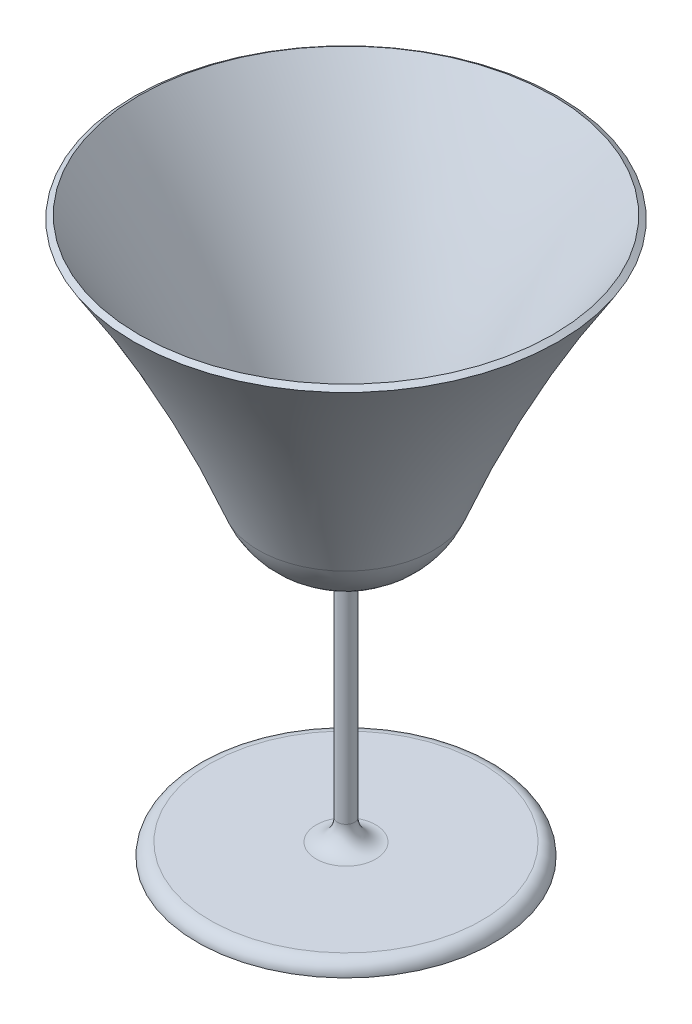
ISO-10303-21;
HEADER;
FILE_DESCRIPTION(('STEP AP214'),'2;1');
FILE_NAME('part.step','',(''),(''),'','','');
FILE_SCHEMA(('AUTOMOTIVE_DESIGN { 1 0 10303 214 1 1 1 1 }'));
ENDSEC;
DATA;
#1=APPLICATION_CONTEXT('core data for automotive mechanical design processes');
#2=APPLICATION_PROTOCOL_DEFINITION('international standard','automotive_design',2000,#1);
#3=PRODUCT_CONTEXT('',#1,'mechanical');
#4=PRODUCT('Part','Part','',(#3));
#5=PRODUCT_RELATED_PRODUCT_CATEGORY('part','',(#4));
#6=PRODUCT_DEFINITION_FORMATION('','',#4);
#7=PRODUCT_DEFINITION_CONTEXT('part definition',#1,'design');
#8=PRODUCT_DEFINITION('design','',#6,#7);
#9=PRODUCT_DEFINITION_SHAPE('','',#8);
#10=(LENGTH_UNIT() NAMED_UNIT(*) SI_UNIT(.MILLI.,.METRE.));
#11=(NAMED_UNIT(*) PLANE_ANGLE_UNIT() SI_UNIT($,.RADIAN.));
#12=(NAMED_UNIT(*) SI_UNIT($,.STERADIAN.) SOLID_ANGLE_UNIT());
#13=UNCERTAINTY_MEASURE_WITH_UNIT(LENGTH_MEASURE(1.E-05),#10,'distance_accuracy_value','');
#14=(GEOMETRIC_REPRESENTATION_CONTEXT(3) GLOBAL_UNCERTAINTY_ASSIGNED_CONTEXT((#13)) GLOBAL_UNIT_ASSIGNED_CONTEXT((#10,
#11,#12)) REPRESENTATION_CONTEXT('',''));
#15=CARTESIAN_POINT('',(0.,0.,0.));
#16=DIRECTION('',(0.,0.,1.));
#17=DIRECTION('',(1.,0.,0.));
#18=AXIS2_PLACEMENT_3D('',#15,#16,#17);
#19=CARTESIAN_POINT('',(0.,-34.7348550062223,0.));
#20=DIRECTION('',(0.,-1.,0.));
#21=DIRECTION('',(0.,0.,-1.));
#22=AXIS2_PLACEMENT_3D('',#19,#20,#21);
#23=DEGENERATE_TOROIDAL_SURFACE('',#22,300.723807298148,301.5,.T.);
#24=CARTESIAN_POINT('',(0.,130.823674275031,0.));
#25=DIRECTION('',(0.,-1.,0.));
#26=DIRECTION('',(0.,0.,-1.));
#27=AXIS2_PLACEMENT_3D('',#24,#25,#26);
#28=CIRCLE('',#27,48.7463809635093);
#29=CARTESIAN_POINT('',(0.,130.823674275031,-48.7463809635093));
#30=VERTEX_POINT('',#29);
#31=EDGE_CURVE('E11',#30,#30,#28,.T.);
#32=ORIENTED_EDGE('',*,*,#31,.F.);
#33=EDGE_LOOP('',(#32));
#34=FACE_BOUND('',#33,.T.);
#35=CARTESIAN_POINT('',(0.,73.3668911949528,0.));
#36=DIRECTION('',(0.,-1.,0.));
#37=DIRECTION('',(0.,0.,-1.));
#38=AXIS2_PLACEMENT_3D('',#35,#36,#37);
#39=CIRCLE('',#38,19.2699701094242);
#40=CARTESIAN_POINT('',(0.,73.3668911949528,-19.2699701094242));
#41=VERTEX_POINT('',#40);
#42=EDGE_CURVE('E60',#41,#41,#39,.T.);
#43=ORIENTED_EDGE('',*,*,#42,.T.);
#44=EDGE_LOOP('',(#43));
#45=FACE_BOUND('',#44,.T.);
#46=ADVANCED_FACE('F38',(#34,#45),#23,.T.);
#47=CARTESIAN_POINT('',(0.,130.,0.));
#48=DIRECTION('',(0.,-1.,0.));
#49=DIRECTION('',(0.,0.,-1.));
#50=AXIS2_PLACEMENT_3D('',#47,#48,#49);
#51=CONICAL_SURFACE('',#50,50.,0.989489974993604);
#52=ORIENTED_EDGE('',*,*,#31,.T.);
#53=EDGE_LOOP('',(#52));
#54=FACE_BOUND('',#53,.T.);
#55=CARTESIAN_POINT('',(0.,130.,0.));
#56=DIRECTION('',(0.,-1.,0.));
#57=DIRECTION('',(0.,0.,-1.));
#58=AXIS2_PLACEMENT_3D('',#55,#56,#57);
#59=CIRCLE('',#58,50.);
#60=CARTESIAN_POINT('',(0.,130.,-50.));
#61=VERTEX_POINT('',#60);
#62=EDGE_CURVE('E44',#61,#61,#59,.T.);
#63=ORIENTED_EDGE('',*,*,#62,.F.);
#64=EDGE_LOOP('',(#63));
#65=FACE_BOUND('',#64,.T.);
#66=ADVANCED_FACE('F83',(#54,#65),#51,.T.);
#67=CARTESIAN_POINT('',(0.,-34.7348550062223,0.));
#68=DIRECTION('',(0.,-1.,0.));
#69=DIRECTION('',(0.,0.,-1.));
#70=AXIS2_PLACEMENT_3D('',#67,#68,#69);
#71=TOROIDAL_SURFACE('',#70,300.723807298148,300.);
#72=ORIENTED_EDGE('',*,*,#62,.T.);
#73=EDGE_LOOP('',(#72));
#74=FACE_BOUND('',#73,.T.);
#75=CARTESIAN_POINT('',(0.,72.8290715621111,0.));
#76=DIRECTION('',(0.,-1.,0.));
#77=DIRECTION('',(0.,0.,-1.));
#78=AXIS2_PLACEMENT_3D('',#75,#76,#77);
#79=CIRCLE('',#78,20.6702379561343);
#80=CARTESIAN_POINT('',(0.,72.8290715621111,-20.6702379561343));
#81=VERTEX_POINT('',#80);
#82=EDGE_CURVE('E48',#81,#81,#79,.T.);
#83=ORIENTED_EDGE('',*,*,#82,.F.);
#84=EDGE_LOOP('',(#83));
#85=FACE_BOUND('',#84,.T.);
#86=ADVANCED_FACE('F79',(#74,#85),#71,.F.);
#87=CARTESIAN_POINT('',(0.,80.,0.));
#88=DIRECTION('',(0.,-1.,0.));
#89=DIRECTION('',(0.,0.,-1.));
#90=AXIS2_PLACEMENT_3D('',#87,#88,#89);
#91=DEGENERATE_TOROIDAL_SURFACE('',#90,2.,20.,.T.);
#92=ORIENTED_EDGE('',*,*,#82,.T.);
#93=EDGE_LOOP('',(#92));
#94=FACE_BOUND('',#93,.T.);
#95=CARTESIAN_POINT('',(0.,60.,0.));
#96=DIRECTION('',(0.,-1.,0.));
#97=DIRECTION('',(0.,0.,-1.));
#98=AXIS2_PLACEMENT_3D('',#95,#96,#97);
#99=CIRCLE('',#98,2.);
#100=CARTESIAN_POINT('',(0.,60.,-2.));
#101=VERTEX_POINT('',#100);
#102=EDGE_CURVE('E52',#101,#101,#99,.T.);
#103=ORIENTED_EDGE('',*,*,#102,.F.);
#104=EDGE_LOOP('',(#103));
#105=FACE_BOUND('',#104,.T.);
#106=ADVANCED_FACE('F73',(#94,#105),#91,.T.);
#107=CARTESIAN_POINT('',(0.,86.6585907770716,0.));
#108=DIRECTION('',(0.,-1.,0.));
#109=DIRECTION('',(0.,0.,-1.));
#110=AXIS2_PLACEMENT_3D('',#107,#108,#109);
#111=CYLINDRICAL_SURFACE('',#110,2.);
#112=ORIENTED_EDGE('',*,*,#102,.T.);
#113=EDGE_LOOP('',(#112));
#114=FACE_BOUND('',#113,.T.);
#115=CARTESIAN_POINT('',(0.,61.5,0.));
#116=DIRECTION('',(0.,-1.,0.));
#117=DIRECTION('',(0.,0.,-1.));
#118=AXIS2_PLACEMENT_3D('',#115,#116,#117);
#119=CIRCLE('',#118,2.);
#120=CARTESIAN_POINT('',(0.,61.5,-2.));
#121=VERTEX_POINT('',#120);
#122=EDGE_CURVE('E57',#121,#121,#119,.T.);
#123=ORIENTED_EDGE('',*,*,#122,.F.);
#124=EDGE_LOOP('',(#123));
#125=FACE_BOUND('',#124,.T.);
#126=ADVANCED_FACE('F68',(#114,#125),#111,.F.);
#127=CARTESIAN_POINT('',(0.,80.,0.));
#128=DIRECTION('',(0.,-1.,0.));
#129=DIRECTION('',(0.,0.,-1.));
#130=AXIS2_PLACEMENT_3D('',#127,#128,#129);
#131=DEGENERATE_TOROIDAL_SURFACE('',#130,2.,18.5,.T.);
#132=ORIENTED_EDGE('',*,*,#42,.F.);
#133=EDGE_LOOP('',(#132));
#134=FACE_BOUND('',#133,.T.);
#135=ORIENTED_EDGE('',*,*,#122,.T.);
#136=EDGE_LOOP('',(#135));
#137=FACE_BOUND('',#136,.T.);
#138=ADVANCED_FACE('F65',(#134,#137),#131,.F.);
#139=CLOSED_SHELL('',(#46,#66,#86,#106,#126,#138));
#140=MANIFOLD_SOLID_BREP('B2',#139);
#141=CARTESIAN_POINT('',(0.,0.,0.));
#142=DIRECTION('',(0.,-1.,0.));
#143=DIRECTION('',(1.,0.,0.));
#144=AXIS2_PLACEMENT_3D('',#141,#142,#143);
#145=PLANE('',#144);
#146=CARTESIAN_POINT('',(0.,0.,0.));
#147=DIRECTION('',(0.,1.,0.));
#148=DIRECTION('',(-1.,0.,0.));
#149=AXIS2_PLACEMENT_3D('',#146,#147,#148);
#150=CIRCLE('',#149,35.);
#151=CARTESIAN_POINT('',(-35.,0.,0.));
#152=VERTEX_POINT('',#151);
#153=EDGE_CURVE('E37',#152,#152,#150,.T.);
#154=ORIENTED_EDGE('',*,*,#153,.F.);
#155=EDGE_LOOP('',(#154));
#156=FACE_BOUND('',#155,.T.);
#157=ADVANCED_FACE('F130',(#156),#145,.T.);
#158=CARTESIAN_POINT('',(0.,0.,0.));
#159=DIRECTION('',(0.,1.,0.));
#160=DIRECTION('',(-1.,0.,0.));
#161=AXIS2_PLACEMENT_3D('',#158,#159,#160);
#162=TOROIDAL_SURFACE('',#161,32.,2.99999999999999);
#163=ORIENTED_EDGE('',*,*,#153,.T.);
#164=EDGE_LOOP('',(#163));
#165=FACE_BOUND('',#164,.T.);
#166=CARTESIAN_POINT('',(0.,2.99999999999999,0.));
#167=DIRECTION('',(0.,1.,0.));
#168=DIRECTION('',(-1.,0.,0.));
#169=AXIS2_PLACEMENT_3D('',#166,#167,#168);
#170=CIRCLE('',#169,32.);
#171=CARTESIAN_POINT('',(-32.,2.99999999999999,0.));
#172=VERTEX_POINT('',#171);
#173=EDGE_CURVE('E136',#172,#172,#170,.T.);
#174=ORIENTED_EDGE('',*,*,#173,.F.);
#175=EDGE_LOOP('',(#174));
#176=FACE_BOUND('',#175,.T.);
#177=ADVANCED_FACE('F233',(#165,#176),#162,.T.);
#178=CARTESIAN_POINT('',(-32.,2.99999999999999,0.));
#179=DIRECTION('',(0.,1.,0.));
#180=DIRECTION('',(-1.,0.,0.));
#181=AXIS2_PLACEMENT_3D('',#178,#179,#180);
#182=PLANE('',#181);
#183=ORIENTED_EDGE('',*,*,#173,.T.);
#184=EDGE_LOOP('',(#183));
#185=FACE_BOUND('',#184,.T.);
#186=CARTESIAN_POINT('',(0.,3.,0.));
#187=DIRECTION('',(0.,1.,0.));
#188=DIRECTION('',(-1.,0.,0.));
#189=AXIS2_PLACEMENT_3D('',#186,#187,#188);
#190=CIRCLE('',#189,6.99999999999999);
#191=CARTESIAN_POINT('',(-6.99999999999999,3.,0.));
#192=VERTEX_POINT('',#191);
#193=EDGE_CURVE('E140',#192,#192,#190,.T.);
#194=ORIENTED_EDGE('',*,*,#193,.F.);
#195=EDGE_LOOP('',(#194));
#196=FACE_BOUND('',#195,.T.);
#197=ADVANCED_FACE('F230',(#185,#196),#182,.T.);
#198=CARTESIAN_POINT('',(0.,8.,0.));
#199=DIRECTION('',(0.,1.,0.));
#200=DIRECTION('',(-1.,0.,0.));
#201=AXIS2_PLACEMENT_3D('',#198,#199,#200);
#202=TOROIDAL_SURFACE('',#201,6.99999999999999,5.);
#203=ORIENTED_EDGE('',*,*,#193,.T.);
#204=EDGE_LOOP('',(#203));
#205=FACE_BOUND('',#204,.T.);
#206=CARTESIAN_POINT('',(0.,7.99999999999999,0.));
#207=DIRECTION('',(0.,1.,0.));
#208=DIRECTION('',(-1.,0.,0.));
#209=AXIS2_PLACEMENT_3D('',#206,#207,#208);
#210=CIRCLE('',#209,1.99999999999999);
#211=CARTESIAN_POINT('',(-1.99999999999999,7.99999999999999,0.));
#212=VERTEX_POINT('',#211);
#213=EDGE_CURVE('E144',#212,#212,#210,.T.);
#214=ORIENTED_EDGE('',*,*,#213,.F.);
#215=EDGE_LOOP('',(#214));
#216=FACE_BOUND('',#215,.T.);
#217=ADVANCED_FACE('F226',(#205,#216),#202,.F.);
#218=CARTESIAN_POINT('',(0.,60.,0.));
#219=DIRECTION('',(0.,1.,0.));
#220=DIRECTION('',(-1.,0.,0.));
#221=AXIS2_PLACEMENT_3D('',#218,#219,#220);
#222=CYLINDRICAL_SURFACE('',#221,2.);
#223=ORIENTED_EDGE('',*,*,#213,.T.);
#224=EDGE_LOOP('',(#223));
#225=FACE_BOUND('',#224,.T.);
#226=CARTESIAN_POINT('',(0.,60.,0.));
#227=DIRECTION('',(0.,1.,0.));
#228=DIRECTION('',(-1.,0.,0.));
#229=AXIS2_PLACEMENT_3D('',#226,#227,#228);
#230=CIRCLE('',#229,2.);
#231=CARTESIAN_POINT('',(-1.99999999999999,60.,0.));
#232=VERTEX_POINT('',#231);
#233=EDGE_CURVE('E149',#232,#232,#230,.T.);
#234=ORIENTED_EDGE('',*,*,#233,.F.);
#235=EDGE_LOOP('',(#234));
#236=FACE_BOUND('',#235,.T.);
#237=ADVANCED_FACE('F222',(#225,#236),#222,.T.);
#238=CARTESIAN_POINT('',(-1.99999999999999,60.,0.));
#239=DIRECTION('',(0.,1.,0.));
#240=DIRECTION('',(-1.,0.,0.));
#241=AXIS2_PLACEMENT_3D('',#238,#239,#240);
#242=PLANE('',#241);
#243=ORIENTED_EDGE('',*,*,#233,.T.);
#244=EDGE_LOOP('',(#243));
#245=FACE_BOUND('',#244,.T.);
#246=ADVANCED_FACE('F219',(#245),#242,.T.);
#247=CLOSED_SHELL('',(#157,#177,#197,#217,#237,#246));
#248=CARTESIAN_POINT('',(0.,60.,0.));
#249=DIRECTION('',(0.,1.,0.));
#250=DIRECTION('',(-1.,0.,0.));
#251=AXIS2_PLACEMENT_3D('',#248,#249,#250);
#252=CYLINDRICAL_SURFACE('',#251,0.5);
#253=CARTESIAN_POINT('',(0.,59.5,0.));
#254=DIRECTION('',(0.,1.,0.));
#255=DIRECTION('',(-1.,0.,0.));
#256=AXIS2_PLACEMENT_3D('',#253,#254,#255);
#257=CIRCLE('',#256,0.5);
#258=CARTESIAN_POINT('',(-0.499999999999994,59.5,0.));
#259=VERTEX_POINT('',#258);
#260=EDGE_CURVE('E170',#259,#259,#257,.T.);
#261=ORIENTED_EDGE('',*,*,#260,.F.);
#262=EDGE_LOOP('',(#261));
#263=FACE_BOUND('',#262,.T.);
#264=CARTESIAN_POINT('',(0.,0.5,0.));
#265=DIRECTION('',(0.,1.,0.));
#266=DIRECTION('',(-1.,0.,0.));
#267=AXIS2_PLACEMENT_3D('',#264,#265,#266);
#268=CIRCLE('',#267,0.5);
#269=CARTESIAN_POINT('',(-0.5,0.5,0.));
#270=VERTEX_POINT('',#269);
#271=EDGE_CURVE('E152',#270,#270,#268,.T.);
#272=ORIENTED_EDGE('',*,*,#271,.T.);
#273=EDGE_LOOP('',(#272));
#274=FACE_BOUND('',#273,.T.);
#275=ADVANCED_FACE('F176',(#263,#274),#252,.T.);
#276=CARTESIAN_POINT('',(-32.,0.499999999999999,0.));
#277=DIRECTION('',(0.,-1.,0.));
#278=DIRECTION('',(1.,0.,0.));
#279=AXIS2_PLACEMENT_3D('',#276,#277,#278);
#280=PLANE('',#279);
#281=ORIENTED_EDGE('',*,*,#271,.F.);
#282=EDGE_LOOP('',(#281));
#283=FACE_BOUND('',#282,.T.);
#284=CARTESIAN_POINT('',(0.,0.499999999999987,0.));
#285=DIRECTION('',(0.,1.,0.));
#286=DIRECTION('',(-1.,0.,0.));
#287=AXIS2_PLACEMENT_3D('',#284,#285,#286);
#288=CIRCLE('',#287,34.4494897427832);
#289=CARTESIAN_POINT('',(-34.4494897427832,0.49999999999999,0.));
#290=VERTEX_POINT('',#289);
#291=EDGE_CURVE('E155',#290,#290,#288,.T.);
#292=ORIENTED_EDGE('',*,*,#291,.T.);
#293=EDGE_LOOP('',(#292));
#294=FACE_BOUND('',#293,.T.);
#295=ADVANCED_FACE('F179',(#283,#294),#280,.F.);
#296=CARTESIAN_POINT('',(0.,0.,0.));
#297=DIRECTION('',(0.,1.,0.));
#298=DIRECTION('',(-1.,0.,0.));
#299=AXIS2_PLACEMENT_3D('',#296,#297,#298);
#300=TOROIDAL_SURFACE('',#299,32.,2.49999999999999);
#301=ORIENTED_EDGE('',*,*,#291,.F.);
#302=EDGE_LOOP('',(#301));
#303=FACE_BOUND('',#302,.T.);
#304=CARTESIAN_POINT('',(0.,2.5,0.));
#305=DIRECTION('',(0.,1.,0.));
#306=DIRECTION('',(-1.,0.,0.));
#307=AXIS2_PLACEMENT_3D('',#304,#305,#306);
#308=CIRCLE('',#307,32.);
#309=CARTESIAN_POINT('',(-32.,2.5,0.));
#310=VERTEX_POINT('',#309);
#311=EDGE_CURVE('E158',#310,#310,#308,.T.);
#312=ORIENTED_EDGE('',*,*,#311,.T.);
#313=EDGE_LOOP('',(#312));
#314=FACE_BOUND('',#313,.T.);
#315=ADVANCED_FACE('F186',(#303,#314),#300,.F.);
#316=CARTESIAN_POINT('',(-32.,2.5,0.));
#317=DIRECTION('',(0.,1.,0.));
#318=DIRECTION('',(-1.,0.,0.));
#319=AXIS2_PLACEMENT_3D('',#316,#317,#318);
#320=PLANE('',#319);
#321=ORIENTED_EDGE('',*,*,#311,.F.);
#322=EDGE_LOOP('',(#321));
#323=FACE_BOUND('',#322,.T.);
#324=CARTESIAN_POINT('',(0.,2.5,0.));
#325=DIRECTION('',(0.,1.,0.));
#326=DIRECTION('',(-1.,0.,0.));
#327=AXIS2_PLACEMENT_3D('',#324,#325,#326);
#328=CIRCLE('',#327,6.99999999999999);
#329=CARTESIAN_POINT('',(-6.99999999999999,2.5,0.));
#330=VERTEX_POINT('',#329);
#331=EDGE_CURVE('E161',#330,#330,#328,.T.);
#332=ORIENTED_EDGE('',*,*,#331,.T.);
#333=EDGE_LOOP('',(#332));
#334=FACE_BOUND('',#333,.T.);
#335=ADVANCED_FACE('F192',(#323,#334),#320,.F.);
#336=CARTESIAN_POINT('',(0.,8.,0.));
#337=DIRECTION('',(0.,1.,0.));
#338=DIRECTION('',(-1.,0.,0.));
#339=AXIS2_PLACEMENT_3D('',#336,#337,#338);
#340=TOROIDAL_SURFACE('',#339,6.99999999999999,5.5);
#341=ORIENTED_EDGE('',*,*,#331,.F.);
#342=EDGE_LOOP('',(#341));
#343=FACE_BOUND('',#342,.T.);
#344=CARTESIAN_POINT('',(0.,7.99999999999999,0.));
#345=DIRECTION('',(0.,1.,0.));
#346=DIRECTION('',(-1.,0.,0.));
#347=AXIS2_PLACEMENT_3D('',#344,#345,#346);
#348=CIRCLE('',#347,1.49999999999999);
#349=CARTESIAN_POINT('',(-1.49999999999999,7.99999999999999,0.));
#350=VERTEX_POINT('',#349);
#351=EDGE_CURVE('E164',#350,#350,#348,.T.);
#352=ORIENTED_EDGE('',*,*,#351,.T.);
#353=EDGE_LOOP('',(#352));
#354=FACE_BOUND('',#353,.T.);
#355=ADVANCED_FACE('F198',(#343,#354),#340,.T.);
#356=CARTESIAN_POINT('',(0.,60.,0.));
#357=DIRECTION('',(0.,1.,0.));
#358=DIRECTION('',(-1.,0.,0.));
#359=AXIS2_PLACEMENT_3D('',#356,#357,#358);
#360=CYLINDRICAL_SURFACE('',#359,1.5);
#361=ORIENTED_EDGE('',*,*,#351,.F.);
#362=EDGE_LOOP('',(#361));
#363=FACE_BOUND('',#362,.T.);
#364=CARTESIAN_POINT('',(0.,59.5,0.));
#365=DIRECTION('',(0.,1.,0.));
#366=DIRECTION('',(-1.,0.,0.));
#367=AXIS2_PLACEMENT_3D('',#364,#365,#366);
#368=CIRCLE('',#367,1.5);
#369=CARTESIAN_POINT('',(-1.49999999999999,59.5,0.));
#370=VERTEX_POINT('',#369);
#371=EDGE_CURVE('E167',#370,#370,#368,.T.);
#372=ORIENTED_EDGE('',*,*,#371,.T.);
#373=EDGE_LOOP('',(#372));
#374=FACE_BOUND('',#373,.T.);
#375=ADVANCED_FACE('F204',(#363,#374),#360,.F.);
#376=CARTESIAN_POINT('',(-32.,59.5,0.));
#377=DIRECTION('',(0.,1.,0.));
#378=DIRECTION('',(-1.,0.,0.));
#379=AXIS2_PLACEMENT_3D('',#376,#377,#378);
#380=PLANE('',#379);
#381=ORIENTED_EDGE('',*,*,#371,.F.);
#382=EDGE_LOOP('',(#381));
#383=FACE_BOUND('',#382,.T.);
#384=ORIENTED_EDGE('',*,*,#260,.T.);
#385=EDGE_LOOP('',(#384));
#386=FACE_BOUND('',#385,.T.);
#387=ADVANCED_FACE('F174',(#383,#386),#380,.F.);
#388=CLOSED_SHELL('',(#275,#295,#315,#335,#355,#375,#387));
#389=ORIENTED_CLOSED_SHELL('',*,#388,.T.);
#390=BREP_WITH_VOIDS('B6',#247,(#389));
#391=ADVANCED_BREP_SHAPE_REPRESENTATION('',(#18,#140,#390),#14);
#392=SHAPE_DEFINITION_REPRESENTATION(#9,#391);
ENDSEC;
END-ISO-10303-21;
